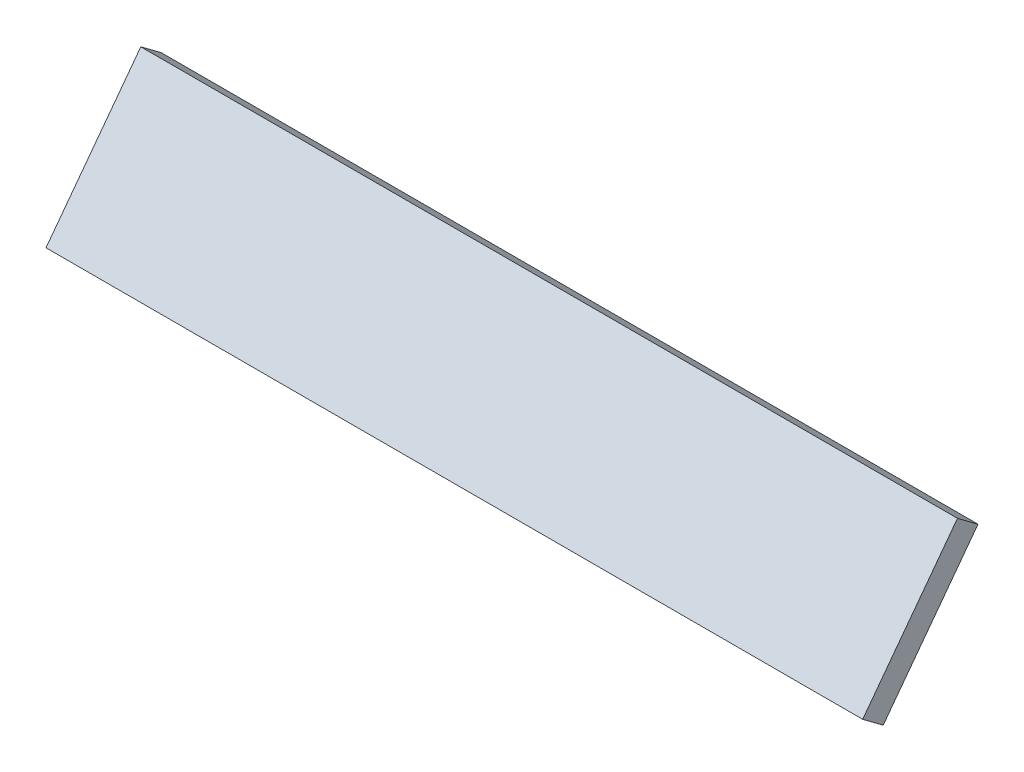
ISO-10303-21;
HEADER;
FILE_DESCRIPTION(('STEP AP214'),'2;1');
FILE_NAME('part.step','',(''),(''),'','','');
FILE_SCHEMA(('AUTOMOTIVE_DESIGN { 1 0 10303 214 1 1 1 1 }'));
ENDSEC;
DATA;
#1=APPLICATION_CONTEXT('core data for automotive mechanical design processes');
#2=APPLICATION_PROTOCOL_DEFINITION('international standard','automotive_design',2000,#1);
#3=PRODUCT_CONTEXT('',#1,'mechanical');
#4=PRODUCT('Part','Part','',(#3));
#5=PRODUCT_RELATED_PRODUCT_CATEGORY('part','',(#4));
#6=PRODUCT_DEFINITION_FORMATION('','',#4);
#7=PRODUCT_DEFINITION_CONTEXT('part definition',#1,'design');
#8=PRODUCT_DEFINITION('design','',#6,#7);
#9=PRODUCT_DEFINITION_SHAPE('','',#8);
#10=(LENGTH_UNIT() NAMED_UNIT(*) SI_UNIT(.MILLI.,.METRE.));
#11=(NAMED_UNIT(*) PLANE_ANGLE_UNIT() SI_UNIT($,.RADIAN.));
#12=(NAMED_UNIT(*) SI_UNIT($,.STERADIAN.) SOLID_ANGLE_UNIT());
#13=UNCERTAINTY_MEASURE_WITH_UNIT(LENGTH_MEASURE(1.E-05),#10,'distance_accuracy_value','');
#14=(GEOMETRIC_REPRESENTATION_CONTEXT(3) GLOBAL_UNCERTAINTY_ASSIGNED_CONTEXT((#13)) GLOBAL_UNIT_ASSIGNED_CONTEXT((#10,
#11,#12)) REPRESENTATION_CONTEXT('',''));
#15=CARTESIAN_POINT('',(0.,0.,0.));
#16=DIRECTION('',(0.,0.,1.));
#17=DIRECTION('',(1.,0.,0.));
#18=AXIS2_PLACEMENT_3D('',#15,#16,#17);
#19=CARTESIAN_POINT('',(-6.6363282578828E-13,-799.236782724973,-1068.17650649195));
#20=DIRECTION('',(0.,-0.599090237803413,-0.800681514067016));
#21=DIRECTION('',(0.,0.800681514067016,-0.599090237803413));
#22=AXIS2_PLACEMENT_3D('',#19,#20,#21);
#23=PLANE('',#22);
#24=DIRECTION('',(1.,0.,0.));
#25=VECTOR('',#24,1.);
#26=CARTESIAN_POINT('',(-406.4,-2455.74128095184,171.262217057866));
#27=LINE('',#26,#25);
#28=CARTESIAN_POINT('',(-406.4,-2455.74128095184,171.262217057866));
#29=VERTEX_POINT('',#28);
#30=CARTESIAN_POINT('',(806.449999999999,-2455.74128095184,171.262217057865));
#31=VERTEX_POINT('',#30);
#32=EDGE_CURVE('E42',#29,#31,#27,.T.);
#33=ORIENTED_EDGE('',*,*,#32,.T.);
#34=DIRECTION('',(0.,0.800681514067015,-0.599090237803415));
#35=VECTOR('',#34,1.);
#36=CARTESIAN_POINT('',(806.449999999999,-2455.74128095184,171.262217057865));
#37=LINE('',#36,#35);
#38=CARTESIAN_POINT('',(806.449999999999,-2267.6211592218,30.5059656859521));
#39=VERTEX_POINT('',#38);
#40=EDGE_CURVE('E95',#31,#39,#37,.T.);
#41=ORIENTED_EDGE('',*,*,#40,.T.);
#42=DIRECTION('',(1.,0.,0.));
#43=VECTOR('',#42,1.);
#44=CARTESIAN_POINT('',(-406.4,-2267.6211592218,30.5059656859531));
#45=LINE('',#44,#43);
#46=CARTESIAN_POINT('',(-406.4,-2267.6211592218,30.5059656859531));
#47=VERTEX_POINT('',#46);
#48=EDGE_CURVE('E88',#47,#39,#45,.T.);
#49=ORIENTED_EDGE('',*,*,#48,.F.);
#50=DIRECTION('',(0.,0.800681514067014,-0.599090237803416));
#51=VECTOR('',#50,1.);
#52=CARTESIAN_POINT('',(-406.4,-2455.74128095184,171.262217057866));
#53=LINE('',#52,#51);
#54=EDGE_CURVE('E71',#29,#47,#53,.T.);
#55=ORIENTED_EDGE('',*,*,#54,.F.);
#56=EDGE_LOOP('',(#33,#41,#49,#55));
#57=FACE_BOUND('',#56,.T.);
#58=ADVANCED_FACE('F33',(#57),#23,.F.);
#59=CARTESIAN_POINT('',(-1.21874433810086E-12,-822.062120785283,-1098.6824721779));
#60=DIRECTION('',(0.,-0.599090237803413,-0.800681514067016));
#61=DIRECTION('',(0.,0.800681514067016,-0.599090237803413));
#62=AXIS2_PLACEMENT_3D('',#59,#60,#61);
#63=PLANE('',#62);
#64=DIRECTION('',(1.,0.,0.));
#65=VECTOR('',#64,1.);
#66=CARTESIAN_POINT('',(-406.4,-2478.56661901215,140.756251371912));
#67=LINE('',#66,#65);
#68=CARTESIAN_POINT('',(-406.4,-2478.56661901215,140.756251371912));
#69=VERTEX_POINT('',#68);
#70=CARTESIAN_POINT('',(806.449999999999,-2478.56661901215,140.756251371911));
#71=VERTEX_POINT('',#70);
#72=EDGE_CURVE('E12',#69,#71,#67,.T.);
#73=ORIENTED_EDGE('',*,*,#72,.F.);
#74=DIRECTION('',(0.,0.800681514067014,-0.599090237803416));
#75=VECTOR('',#74,1.);
#76=CARTESIAN_POINT('',(-406.4,-2478.56661901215,140.756251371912));
#77=LINE('',#76,#75);
#78=CARTESIAN_POINT('',(-406.4,-2290.44649728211,-2.38226829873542E-13));
#79=VERTEX_POINT('',#78);
#80=EDGE_CURVE('E85',#69,#79,#77,.T.);
#81=ORIENTED_EDGE('',*,*,#80,.T.);
#82=DIRECTION('',(1.,0.,0.));
#83=VECTOR('',#82,1.);
#84=CARTESIAN_POINT('',(-406.4,-2290.44649728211,-2.46317942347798E-13));
#85=LINE('',#84,#83);
#86=CARTESIAN_POINT('',(806.449999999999,-2290.44649728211,-1.23729151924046E-12));
#87=VERTEX_POINT('',#86);
#88=EDGE_CURVE('E102',#79,#87,#85,.T.);
#89=ORIENTED_EDGE('',*,*,#88,.T.);
#90=DIRECTION('',(0.,0.800681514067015,-0.599090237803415));
#91=VECTOR('',#90,1.);
#92=CARTESIAN_POINT('',(806.449999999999,-2478.56661901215,140.756251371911));
#93=LINE('',#92,#91);
#94=EDGE_CURVE('E81',#71,#87,#93,.T.);
#95=ORIENTED_EDGE('',*,*,#94,.F.);
#96=EDGE_LOOP('',(#73,#81,#89,#95));
#97=FACE_BOUND('',#96,.T.);
#98=ADVANCED_FACE('F129',(#97),#63,.T.);
#99=CARTESIAN_POINT('',(-406.4,-2478.56661901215,140.756251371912));
#100=DIRECTION('',(1.,0.,0.));
#101=DIRECTION('',(0.,0.,-1.));
#102=AXIS2_PLACEMENT_3D('',#99,#100,#101);
#103=PLANE('',#102);
#104=ORIENTED_EDGE('',*,*,#54,.T.);
#105=DIRECTION('',(0.,0.599090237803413,0.800681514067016));
#106=VECTOR('',#105,1.);
#107=CARTESIAN_POINT('',(-406.4,-2290.44649728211,-2.46317942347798E-13));
#108=LINE('',#107,#106);
#109=EDGE_CURVE('E110',#79,#47,#108,.T.);
#110=ORIENTED_EDGE('',*,*,#109,.F.);
#111=ORIENTED_EDGE('',*,*,#80,.F.);
#112=DIRECTION('',(0.,0.599090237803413,0.800681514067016));
#113=VECTOR('',#112,1.);
#114=CARTESIAN_POINT('',(-406.4,-2478.56661901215,140.756251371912));
#115=LINE('',#114,#113);
#116=EDGE_CURVE('E76',#69,#29,#115,.T.);
#117=ORIENTED_EDGE('',*,*,#116,.T.);
#118=EDGE_LOOP('',(#104,#110,#111,#117));
#119=FACE_BOUND('',#118,.T.);
#120=ADVANCED_FACE('F83',(#119),#103,.F.);
#121=CARTESIAN_POINT('',(-406.4,-2290.44649728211,-2.46317942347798E-13));
#122=DIRECTION('',(0.,-0.800681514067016,0.599090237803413));
#123=DIRECTION('',(0.,-0.599090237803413,-0.800681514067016));
#124=AXIS2_PLACEMENT_3D('',#121,#122,#123);
#125=PLANE('',#124);
#126=ORIENTED_EDGE('',*,*,#48,.T.);
#127=DIRECTION('',(0.,0.599090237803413,0.800681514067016));
#128=VECTOR('',#127,1.);
#129=CARTESIAN_POINT('',(806.449999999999,-2290.44649728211,-1.25919240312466E-12));
#130=LINE('',#129,#128);
#131=EDGE_CURVE('E97',#87,#39,#130,.T.);
#132=ORIENTED_EDGE('',*,*,#131,.F.);
#133=ORIENTED_EDGE('',*,*,#88,.F.);
#134=ORIENTED_EDGE('',*,*,#109,.T.);
#135=EDGE_LOOP('',(#126,#132,#133,#134));
#136=FACE_BOUND('',#135,.T.);
#137=ADVANCED_FACE('F128',(#136),#125,.F.);
#138=CARTESIAN_POINT('',(-406.4,-2478.56661901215,140.756251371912));
#139=DIRECTION('',(0.,-0.800681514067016,0.599090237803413));
#140=DIRECTION('',(0.,-0.599090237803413,-0.800681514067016));
#141=AXIS2_PLACEMENT_3D('',#138,#139,#140);
#142=PLANE('',#141);
#143=ORIENTED_EDGE('',*,*,#32,.F.);
#144=ORIENTED_EDGE('',*,*,#116,.F.);
#145=ORIENTED_EDGE('',*,*,#72,.T.);
#146=DIRECTION('',(0.,0.599090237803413,0.800681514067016));
#147=VECTOR('',#146,1.);
#148=CARTESIAN_POINT('',(806.449999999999,-2478.56661901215,140.756251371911));
#149=LINE('',#148,#147);
#150=EDGE_CURVE('E78',#71,#31,#149,.T.);
#151=ORIENTED_EDGE('',*,*,#150,.T.);
#152=EDGE_LOOP('',(#143,#144,#145,#151));
#153=FACE_BOUND('',#152,.T.);
#154=ADVANCED_FACE('F75',(#153),#142,.T.);
#155=CARTESIAN_POINT('',(806.449999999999,-2478.56661901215,140.756251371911));
#156=DIRECTION('',(1.,0.,0.));
#157=DIRECTION('',(0.,0.,-1.));
#158=AXIS2_PLACEMENT_3D('',#155,#156,#157);
#159=PLANE('',#158);
#160=ORIENTED_EDGE('',*,*,#40,.F.);
#161=ORIENTED_EDGE('',*,*,#150,.F.);
#162=ORIENTED_EDGE('',*,*,#94,.T.);
#163=ORIENTED_EDGE('',*,*,#131,.T.);
#164=EDGE_LOOP('',(#160,#161,#162,#163));
#165=FACE_BOUND('',#164,.T.);
#166=ADVANCED_FACE('F127',(#165),#159,.T.);
#167=CLOSED_SHELL('',(#58,#98,#120,#137,#154,#166));
#168=MANIFOLD_SOLID_BREP('B2',#167);
#169=ADVANCED_BREP_SHAPE_REPRESENTATION('',(#18,#168),#14);
#170=SHAPE_DEFINITION_REPRESENTATION(#9,#169);
ENDSEC;
END-ISO-10303-21;
